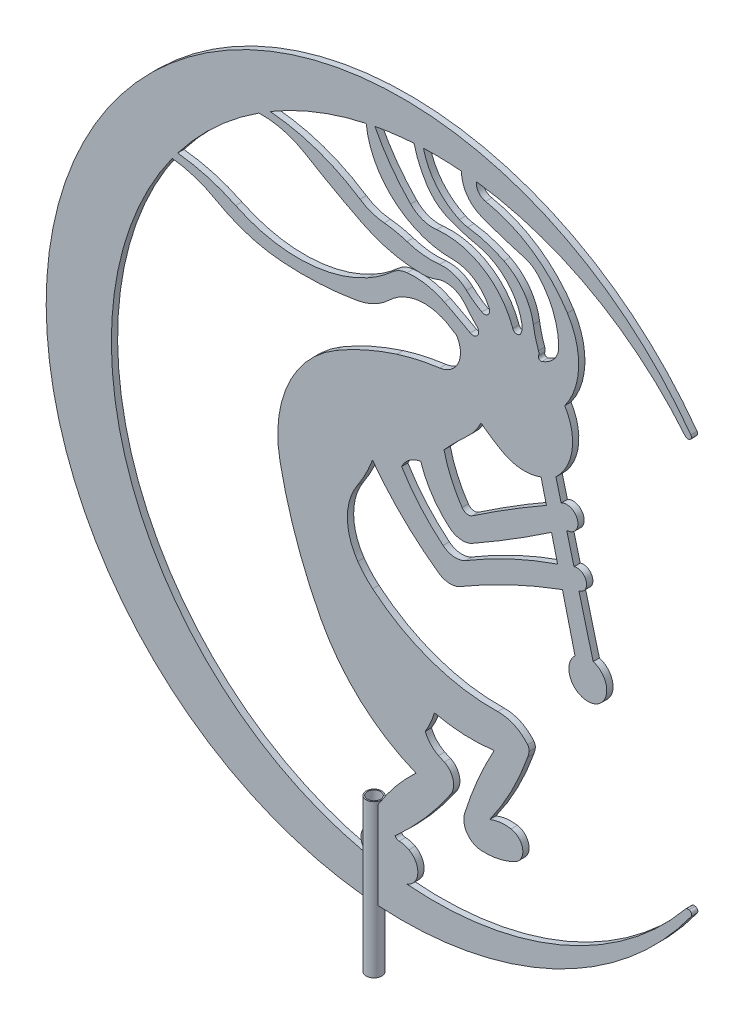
from build123d import *

# Parameters (mm, degrees)
BOSS_EXTRUDE1_DEPTH      = 6.35
BOSS_EXTRUDE2_DEPTH      = 38.1
BOSS_EXTRUDE2_DEPTH_BACK = 116.84
SKETCH2_R                = 7.9375
CUT_EXTRUDE1_REACH       = 899.25
SKETCH3_R                = 6.71429797


with BuildPart() as part:
    # Model → Boss-Extrude1 (new body)
    with BuildSketch(Plane.XY):
        with BuildLine():
            ThreePointArc((103.434089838, -141.874936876), (120.716798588, -174.886235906), (121.809660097, -137.640517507))
            Line((121.809660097, -137.640517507), (107.341819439, -82.735476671))
            Line((107.341819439, -82.735476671), (107.588580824, -82.628494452))
            ThreePointArc((107.588580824, -82.628494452), (114.809086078, -70.536342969), (102.381253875, -63.910272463))
            Line((102.381253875, -63.910272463), (94.994111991, -35.876280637))
            ThreePointArc((94.994111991, -35.876280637), (95.2215504, -35.754945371), (95.449169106, -35.633948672))
            ThreePointArc((95.449169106, -35.633948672), (105.948694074, -21.136240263), (89.346483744, -14.443693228))
            Line((89.346483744, -14.443693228), (84.00883033, 5.812548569))
            ThreePointArc((84.00883033, 5.812548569), (100.452490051, 37.790603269), (93.013357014, 72.970842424))
            ThreePointArc((93.013357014, 72.970842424), (107.087762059, 113.857194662), (95.733162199, 155.580758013))
            ThreePointArc((95.733162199, 155.580758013), (60.042720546, 192.524508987), (12.63048004, 212.291345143))
            ThreePointArc((12.63048004, 212.291345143), (5.469188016, 216.842082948), (3.329845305, 225.052839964))
            ThreePointArc((3.329845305, 225.052839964), (120.634989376, 186.440316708), (215.384853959, 107.232445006))
            ThreePointArc((215.384853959, 107.232445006), (216.942876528, 106.197299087), (218.813301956, 106.218981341))
            Line((218.813301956, 106.218981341), (219.321215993, 106.382017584))
            ThreePointArc((219.321215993, 106.382017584), (221.367709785, 108.415606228), (220.923154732, 111.266218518))
            ThreePointArc((220.923154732, 111.266218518), (-183.315042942, 243.27552728), (-433.439294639, -100.632653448))
            ThreePointArc((-433.439294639, -100.632653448), (-183.154267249, -444.592855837), (221.121135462, -312.257620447))
            ThreePointArc((221.121135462, -312.257620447), (221.51034177, -309.25886611), (219.211606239, -307.29422261))
            Line((219.211606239, -307.29422261), (218.687654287, -307.182075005))
            ThreePointArc((218.687654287, -307.182075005), (216.971130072, -307.291100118), (215.563332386, -308.279253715))
            ThreePointArc((215.563332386, -308.279253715), (89.030227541, -403.112455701), (-67.154006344, -427.819699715))
            ThreePointArc((-67.154006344, -427.819699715), (-56.197810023, -412.84128312), (-65.157325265, -396.589566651))
            ThreePointArc((-65.157325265, -396.589566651), (-69.973189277, -394.648067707), (-75.106515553, -393.86645036))
            ThreePointArc((-75.106515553, -393.86645036), (-77.520180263, -393.14198019), (-79.267396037, -391.325975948))
            ThreePointArc((-79.267396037, -391.325975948), (-49.016941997, -360.712060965), (-22.785731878, -326.591313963))
            ThreePointArc((-22.785731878, -326.591313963), (-20.354122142, -312.530826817), (-29.249351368, -301.373545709))
            ThreePointArc((-29.249351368, -301.373545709), (-32.247950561, -300.206106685), (-35.158192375, -298.83315236))
            ThreePointArc((-35.158192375, -298.83315236), (-43.19100603, -292.708827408), (-48.622753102, -284.192397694))
            ThreePointArc((-48.622753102, -284.192397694), (-43.284424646, -274.019161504), (-39.316975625, -263.237147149))
            ThreePointArc((-39.316975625, -263.237147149), (-9.116063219, -267.414880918), (21.340909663, -266.028745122))
            ThreePointArc((21.340909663, -266.028745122), (4.573942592, -300.449451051), (-8.681930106, -336.36877761))
            ThreePointArc((-8.681930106, -336.36877761), (-6.217481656, -352.54193554), (8.061937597, -360.525839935))
            ThreePointArc((8.061937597, -360.525839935), (25.968437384, -359.098217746), (42.851616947, -352.963147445))
            ThreePointArc((42.851616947, -352.963147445), (50.262615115, -338.1287647), (38.534984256, -326.405092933))
            ThreePointArc((38.534984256, -326.405092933), (27.473736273, -326.17401138), (16.77884206, -329.006650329))
            ThreePointArc((16.77884206, -329.006650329), (38.649923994, -293.402228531), (55.305632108, -255.079826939))
            ThreePointArc((55.305632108, -255.079826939), (56.154021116, -252.277858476), (56.743975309, -249.410325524))
            ThreePointArc((56.743975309, -249.410325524), (56.595474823, -246.575850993), (55.305632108, -244.047491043))
            ThreePointArc((55.305632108, -244.047491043), (41.766778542, -233.517662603), (24.972014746, -230.03718104))
            ThreePointArc((24.972014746, -230.03718104), (-42.601054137, -219.378978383), (-102.058321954, -185.547776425))
            ThreePointArc((-102.058321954, -185.547776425), (-110.154747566, -177.787652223), (-117.151634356, -169.023223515))
            ThreePointArc((-117.151634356, -169.023223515), (-127.666759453, -135.990255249), (-117.753326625, -102.771755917))
            ThreePointArc((-117.753326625, -102.771755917), (-109.113154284, -88.107326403), (-102.187250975, -72.559659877))
            ThreePointArc((-102.187250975, -72.559659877), (-71.182309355, -107.963885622), (-35.049314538, -138.116369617))
            ThreePointArc((-35.049314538, -138.116369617), (-24.142086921, -141.849197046), (-12.959423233, -139.047474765))
            ThreePointArc((-12.959423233, -139.047474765), (37.727296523, -112.159280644), (90.642007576, -89.974783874))
            Line((90.642007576, -89.974783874), (103.434089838, -141.874936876))
        make_face()
        with BuildLine():
            ThreePointArc((-113.19013671, -404.849817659), (-112.400886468, -415.691031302), (-103.949326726, -422.526670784))
            ThreePointArc((-103.949326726, -422.526670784), (-344.586283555, -220.577883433), (-305.474493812, 91.126665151))
            ThreePointArc((-305.474493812, 91.126665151), (-282.394363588, 86.159913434), (-260.831638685, 76.546905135))
            ThreePointArc((-260.831638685, 76.546905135), (-228.528995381, 62.512276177), (-193.900261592, 56.087140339))
            ThreePointArc((-193.900261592, 56.087140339), (-155.687471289, 55.731105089), (-117.714824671, 60.023215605))
            ThreePointArc((-117.714824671, 60.023215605), (-100.26348824, 65.852929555), (-85.291060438, 76.546905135))
            ThreePointArc((-85.291060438, 76.546905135), (-75.955065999, 83.805188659), (-65.27740604, 88.887614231))
            ThreePointArc((-65.27740604, 88.887614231), (-42.904202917, 91.123987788), (-21.965915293, 82.929495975))
            ThreePointArc((-21.965915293, 82.929495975), (-20.268598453, 81.850539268), (-18.484641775, 80.921814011))
            ThreePointArc((-18.484641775, 80.921814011), (-17.313302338, 80.14995648), (-16.413266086, 79.073975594))
            ThreePointArc((-16.413266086, 79.073975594), (-15.207691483, 56.087140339), (-33.856354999, 42.593610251))
            ThreePointArc((-33.856354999, 42.593610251), (-55.885482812, 38.747961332), (-77.481253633, 32.943293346))
            ThreePointArc((-77.481253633, 32.943293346), (-109.431154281, 20.770376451), (-139.802673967, 5.068566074))
            ThreePointArc((-139.802673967, 5.068566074), (-187.921004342, -48.811676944), (-196.047600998, -120.591985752))
            ThreePointArc((-196.047600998, -120.591985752), (-179.590921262, -180.773932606), (-154.720726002, -237.994229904))
            ThreePointArc((-154.720726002, -237.994229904), (-114.179016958, -290.43293551), (-58.002011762, -325.61236281))
            ThreePointArc((-58.002011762, -325.61236281), (-89.82843825, -362.283289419), (-113.19013671, -404.849817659))
        make_face(mode=Mode.SUBTRACT)
        with BuildLine():
            ThreePointArc((-82.228886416, 102.978990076), (-93.975797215, 93.535803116), (-106.726278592, 85.499080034))
            ThreePointArc((-106.726278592, 85.499080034), (-173.491689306, 67.301481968), (-241.14593954, 81.85053927))
            ThreePointArc((-241.14593954, 81.85053927), (-269.827249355, 92.770969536), (-299.965843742, 98.56220933))
            ThreePointArc((-299.965843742, 98.56220933), (-262.040850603, 140.291990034), (-217.536225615, 174.918830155))
            ThreePointArc((-217.536225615, 174.918830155), (-193.04261506, 172.244649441), (-170.341728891, 162.665611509))
            ThreePointArc((-170.341728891, 162.665611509), (-141.704772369, 146.078511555), (-112.440538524, 130.624975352))
            ThreePointArc((-112.440538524, 130.624975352), (-82.792599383, 119.847214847), (-51.449295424, 116.275420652))
            ThreePointArc((-51.449295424, 116.275420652), (-44.056739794, 117.000722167), (-36.928593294, 119.090092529))
            ThreePointArc((-36.928593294, 119.090092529), (-21.266411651, 120.014438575), (-8.149144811, 111.406554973))
            ThreePointArc((-8.149144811, 111.406554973), (-2.309804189, 104.464922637), (3.924128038, 97.875366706))
            ThreePointArc((3.924128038, 97.875366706), (4.433592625, 90.385615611), (-2.922487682, 88.887614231))
            ThreePointArc((-2.922487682, 88.887614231), (-16.005398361, 96.111442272), (-29.278793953, 102.978990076))
            ThreePointArc((-29.278793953, 102.978990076), (-47.727090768, 109.101732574), (-67.154006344, 109.751795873))
            ThreePointArc((-67.154006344, 109.751795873), (-75.224405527, 107.551650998), (-82.228886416, 102.978990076))
        make_face(mode=Mode.SUBTRACT)
        with BuildLine():
            Line((85.715554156, -69.987132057), (85.710410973, -69.989006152))
            ThreePointArc((85.710410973, -69.989006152), (38.106369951, -89.240462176), (-7.227212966, -113.357459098))
            ThreePointArc((-7.227212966, -113.357459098), (-19.17915239, -116.207351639), (-30.588730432, -111.647497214))
            ThreePointArc((-30.588730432, -111.647497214), (-53.61814559, -89.275287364), (-72.604345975, -63.383320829))
            ThreePointArc((-72.604345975, -63.383320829), (-64.668004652, -53.878526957), (-53.218975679, -49.1619227))
            ThreePointArc((-53.218975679, -49.1619227), (-41.59859394, -73.035723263), (-23.898401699, -92.827004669))
            ThreePointArc((-23.898401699, -92.827004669), (-12.661855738, -97.553011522), (-0.742605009, -94.998296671))
            ThreePointArc((-0.742605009, -94.998296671), (39.918665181, -70.87297718), (79.597073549, -45.163176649))
            Line((79.597073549, -45.163176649), (85.715554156, -69.987132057))
        make_face(mode=Mode.SUBTRACT)
        with BuildLine():
            ThreePointArc((29.229864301, 1.083696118), (48.742015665, -4.854616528), (68.905522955, -1.785319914))
            Line((68.905522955, -1.785319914), (74.389880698, -24.036506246))
            ThreePointArc((74.389880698, -24.036506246), (74.387364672, -24.037936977), (74.384848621, -24.039367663))
            ThreePointArc((74.384848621, -24.039367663), (36.390754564, -46.63963106), (-0.688719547, -70.711101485))
            ThreePointArc((-0.688719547, -70.711101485), (-6.404198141, -71.884716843), (-11.274409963, -68.671446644))
            ThreePointArc((-11.274409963, -68.671446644), (-22.281800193, -48.764779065), (-29.564764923, -27.214918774))
            ThreePointArc((-29.564764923, -27.214918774), (-17.997233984, -14.968476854), (-5.84670301, -3.30024182))
            ThreePointArc((-5.84670301, -3.30024182), (1.94994827, 5.296769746), (8.014329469, 15.192206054))
            ThreePointArc((8.014329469, 15.192206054), (18.381545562, 7.77622437), (29.229864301, 1.083696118))
        make_face(mode=Mode.SUBTRACT)
        with BuildLine():
            ThreePointArc((-90.290443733, 141.958938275), (-103.053420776, 144.713569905), (-114.751190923, 150.513893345))
            ThreePointArc((-114.751190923, 150.513893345), (-158.424024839, 172.050610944), (-206.088555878, 182.012493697))
            ThreePointArc((-206.088555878, 182.012493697), (-158.868773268, 205.064855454), (-108.576794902, 220.291022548))
            ThreePointArc((-108.576794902, 220.291022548), (-102.583430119, 197.164363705), (-90.168395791, 176.752854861))
            ThreePointArc((-90.168395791, 176.752854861), (-59.321974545, 152.981413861), (-21.266411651, 144.713569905))
            ThreePointArc((-21.266411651, 144.713569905), (1.272640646, 138.049911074), (16.299222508, 119.977416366))
            ThreePointArc((16.299222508, 119.977416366), (14.97267176, 113.943834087), (8.842400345, 113.179880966))
            ThreePointArc((8.842400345, 113.179880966), (0.664579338, 118.279660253), (-6.76620035, 124.417087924))
            ThreePointArc((-6.76620035, 124.417087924), (-19.411326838, 132.006675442), (-34.072987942, 133.599395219))
            ThreePointArc((-34.072987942, 133.599395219), (-50.804621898, 133.589482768), (-67.154006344, 137.145506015))
            ThreePointArc((-67.154006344, 137.145506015), (-78.581964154, 140.226405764), (-90.290443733, 141.958938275))
        make_face(mode=Mode.SUBTRACT)
        with BuildLine():
            ThreePointArc((-99.749732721, 222.082028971), (-79.986331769, 225.190459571), (-60.07032787, 227.089708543))
            ThreePointArc((-60.07032787, 227.089708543), (-54.641576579, 211.169011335), (-46.589338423, 196.400754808))
            ThreePointArc((-46.589338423, 196.400754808), (-36.743702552, 185.548080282), (-24.096103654, 178.148395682))
            ThreePointArc((-24.096103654, 178.148395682), (-10.264984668, 173.339932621), (3.924128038, 169.721887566))
            ThreePointArc((3.924128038, 169.721887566), (33.835507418, 153.295039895), (49.550349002, 123.003527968))
            ThreePointArc((49.550349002, 123.003527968), (49.674420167, 118.40798254), (48.376860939, 113.997679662))
            ThreePointArc((48.376860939, 113.997679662), (44.169928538, 111.488213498), (40.248586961, 114.423989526))
            ThreePointArc((40.248586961, 114.423989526), (10.090111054, 152.087432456), (-36.986111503, 162.665611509))
            ThreePointArc((-36.986111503, 162.665611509), (-51.333391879, 164.263959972), (-63.523188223, 171.997525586))
            ThreePointArc((-63.523188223, 171.997525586), (-83.54390124, 195.660109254), (-99.749732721, 222.082028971))
        make_face(mode=Mode.SUBTRACT)
        with BuildLine():
            ThreePointArc((-11.791081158, 226.656955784), (-6.449875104, 208.655393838), (8.255800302, 196.979443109))
            ThreePointArc((8.255800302, 196.979443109), (29.986001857, 189.263330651), (52.064130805, 182.607786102))
            ThreePointArc((52.064130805, 182.607786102), (59.222486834, 179.545273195), (65.29807644, 174.676160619))
            ThreePointArc((65.29807644, 174.676160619), (81.048046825, 150.305572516), (86.875822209, 121.879806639))
            ThreePointArc((86.875822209, 121.879806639), (85.437898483, 114.030652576), (81.088482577, 107.340404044))
            ThreePointArc((81.088482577, 107.340404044), (75.811902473, 103.061719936), (69.696661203, 100.103129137))
            ThreePointArc((69.696661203, 100.103129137), (67.012397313, 100.708464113), (66.371944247, 103.384566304))
            ThreePointArc((66.371944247, 103.384566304), (66.721917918, 105.620037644), (66.32039672, 107.846827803))
            ThreePointArc((66.32039672, 107.846827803), (63.222606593, 117.95938655), (61.108139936, 128.322261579))
            ThreePointArc((61.108139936, 128.322261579), (51.183996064, 152.418335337), (31.342034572, 169.312297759))
            ThreePointArc((31.342034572, 169.312297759), (13.377405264, 176.522503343), (-5.558227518, 180.542053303))
            ThreePointArc((-5.558227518, 180.542053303), (-9.933633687, 181.436520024), (-14.114633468, 183.006071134))
            ThreePointArc((-14.114633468, 183.006071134), (-37.377394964, 201.140611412), (-50.473882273, 227.569755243))
            ThreePointArc((-50.473882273, 227.569755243), (-31.119026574, 227.683560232), (-11.791081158, 226.656955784))
        make_face(mode=Mode.SUBTRACT)
    extrude(amount=BOSS_EXTRUDE1_DEPTH)

    # Sketch2 → Boss-Extrude2 (add, two sides: drawn at the far end of the back side and taken through both)
    with BuildSketch(Plane.XZ.offset(486.577971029).offset(-BOSS_EXTRUDE2_DEPTH_BACK)):
        with Locations(Location((-103.910915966, 3.126765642, 0), (0, 0, 270))):
            Circle(SKETCH2_R)
    extrude(amount=BOSS_EXTRUDE2_DEPTH + BOSS_EXTRUDE2_DEPTH_BACK)

    # Sketch3 → Cut-Extrude1 (cut, up to next)
    with BuildSketch(Plane.XZ.offset(524.677971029), mode=Mode.PRIVATE) as cut_extrude1_sk1:
        with Locations(Location((-103.910915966, 3.126765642, 0), (0, 0, 270))):
            Circle(SKETCH3_R)
    cut_extrude1_tool1 = extrude(cut_extrude1_sk1.sketch, amount=-CUT_EXTRUDE1_REACH, mode=Mode.PRIVATE) & part.part
    add(cut_extrude1_tool1.solids().sort_by_distance((-103.910916, -524.677971, 3.126766))[0], mode=Mode.SUBTRACT)


solid = part.part
